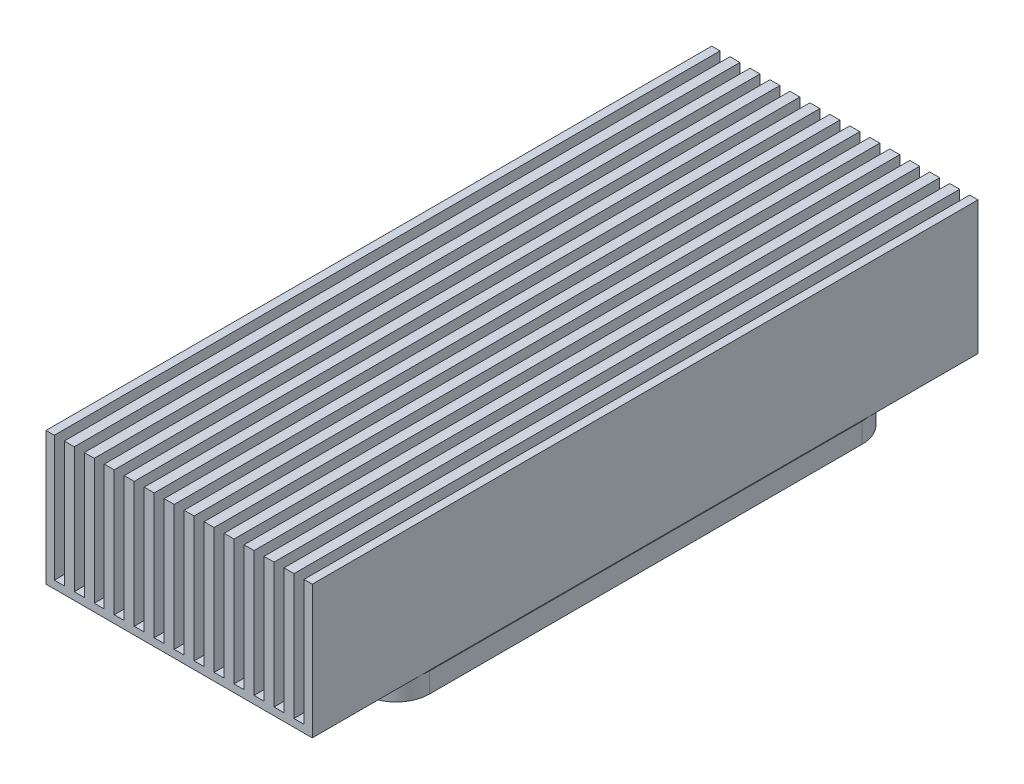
from build123d import *

# Parameters (mm, degrees)
BOSS_EXTRU_1_DEPTH      = 50
SUPPORT_DEPTH           = 3
ESQUISSE3_W             = 25
ESQUISSE3_H             = 25
LED_DEPTH               = 1
ESQUISSE4_R             = 1.5
ENL_V_MAT_EXTRU_3_DEPTH = 20


with BuildPart() as part:
    # Esquisse1 → Boss.-Extru.1 (new, symmetric)
    with BuildSketch(Plane.XY):
        Polygon((-20, 20), (-18.75, 20), (-18.75, 1.147539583), (-17.25, 1.147539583), (-17.25, 20), (-15.75, 20), (-15.75, 1.147539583), (-14.25, 1.147539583), (-14.25, 20), (-12.75, 20), (-12.75, 1.147539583), (-11.25, 1.147539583), (-11.25, 20), (-9.75, 20), (-9.75, 1.147539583), (-8.25, 1.147539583), (-8.25, 20), (-6.75, 20), (-6.75, 1.147539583), (-5.25, 1.147539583), (-5.25, 20), (-3.75, 20), (-3.75, 1.147539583), (-2.25, 1.147539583), (-2.25, 20), (-0.75, 20), (-0.75, 1.147539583), (0.75, 1.147539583), (0.75, 20), (2.25, 20), (2.25, 1.147539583), (3.75, 1.147539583), (3.75, 20), (5.25, 20), (5.25, 1.147539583), (6.75, 1.147539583), (6.75, 20), (8.25, 20), (8.25, 1.147539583), (9.75, 1.147539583), (9.75, 20), (11.25, 20), (11.25, 1.147539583), (12.75, 1.147539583), (12.75, 20), (14.25, 20), (14.25, 1.147539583), (15.75, 1.147539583), (15.75, 20), (17.25, 20), (17.25, 1.147539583), (18.75, 1.147539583), (18.75, 20), (20, 20), (20, 0), (-20, 0), align=None)
    extrude(amount=BOSS_EXTRU_1_DEPTH, both=True)

    # Esquisse2 → Support (add)
    with BuildSketch(Plane.XZ):
        with BuildLine():
            Line((-15.1, -37.5), (15.1, -37.5))
            ThreePointArc((15.1, -37.5), (18.635533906, -36.035533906), (20.1, -32.5))
            Line((20.1, -32.5), (20.1, 32.5))
            ThreePointArc((20.1, 32.5), (18.635533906, 36.035533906), (15.1, 37.5))
            Line((15.1, 37.5), (-15.1, 37.5))
            ThreePointArc((-15.1, 37.5), (-18.635533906, 36.035533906), (-20.1, 32.5))
            Line((-20.1, 32.5), (-20.1, -32.5))
            ThreePointArc((-20.1, -32.5), (-18.635533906, -36.035533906), (-15.1, -37.5))
        make_face()
    extrude(amount=SUPPORT_DEPTH)

    # Esquisse3 → Led (add)
    with BuildSketch(Plane.XZ.offset(3)):
        Rectangle(ESQUISSE3_W, ESQUISSE3_H)
    extrude(amount=LED_DEPTH)

    # Esquisse4 → Enl_v. mat.-Extru.3 (cut)
    with BuildSketch(Plane(origin=(0, -3, -3), x_dir=(-1, 0, 0), z_dir=(0, 1, 0))):
        with Locations(Location((17, 20, 0), (0, 0, 146.442690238))):
            Circle(ESQUISSE4_R)
        with Locations(Location((17, -14, 0), (0, 0, 146.442690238))):
            Circle(ESQUISSE4_R)
        with Locations(Location((-17, -14, 0), (0, 0, 99.594068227))):
            Circle(ESQUISSE4_R)
        with Locations(Location((-17, 20, 0), (0, 0, 99.594068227))):
            Circle(ESQUISSE4_R)
    extrude(amount=ENL_V_MAT_EXTRU_3_DEPTH, mode=Mode.SUBTRACT)


solid = part.part
